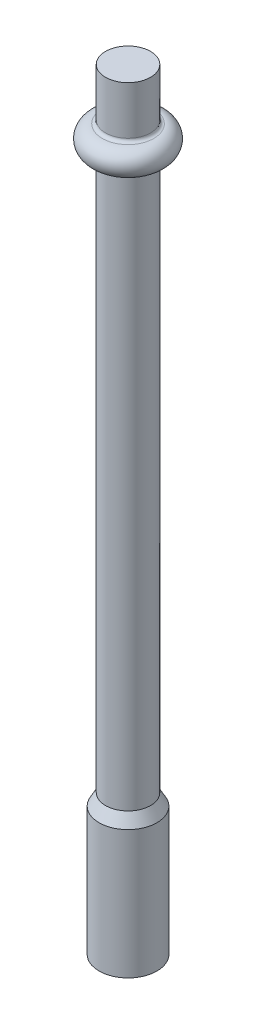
from build123d import *


with BuildPart() as part:
    # Sketch1 → Revolve1 (revolve)
    with BuildSketch(Plane.XY, mode=Mode.PRIVATE) as revolve1_sk:
        with BuildLine():
            Line((0, 0), (0, 120))
            Line((0, 120), (3.5, 120))
            Line((3.5, 120), (3.5, 112.5))
            ThreePointArc((3.5, 112.5), (3.646446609, 112.146446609), (4, 112))
            ThreePointArc((4, 112), (6, 110), (4, 108))
            ThreePointArc((4, 108), (3.646446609, 107.853553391), (3.5, 107.5))
            Line((3.5, 107.5), (3.5, 21.810248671))
            Line((3.5, 21.810248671), (4.5, 20))
            Line((4.5, 20), (4.5, 0))
            Line((4.5, 0), (0, 0))
        make_face()
    revolve(revolve1_sk.sketch.rotate(Axis((0, 0, 0), (0, 1, 0)), 90), axis=Axis((0, 0, 0), (0, 1, 0)))


solid = part.part
